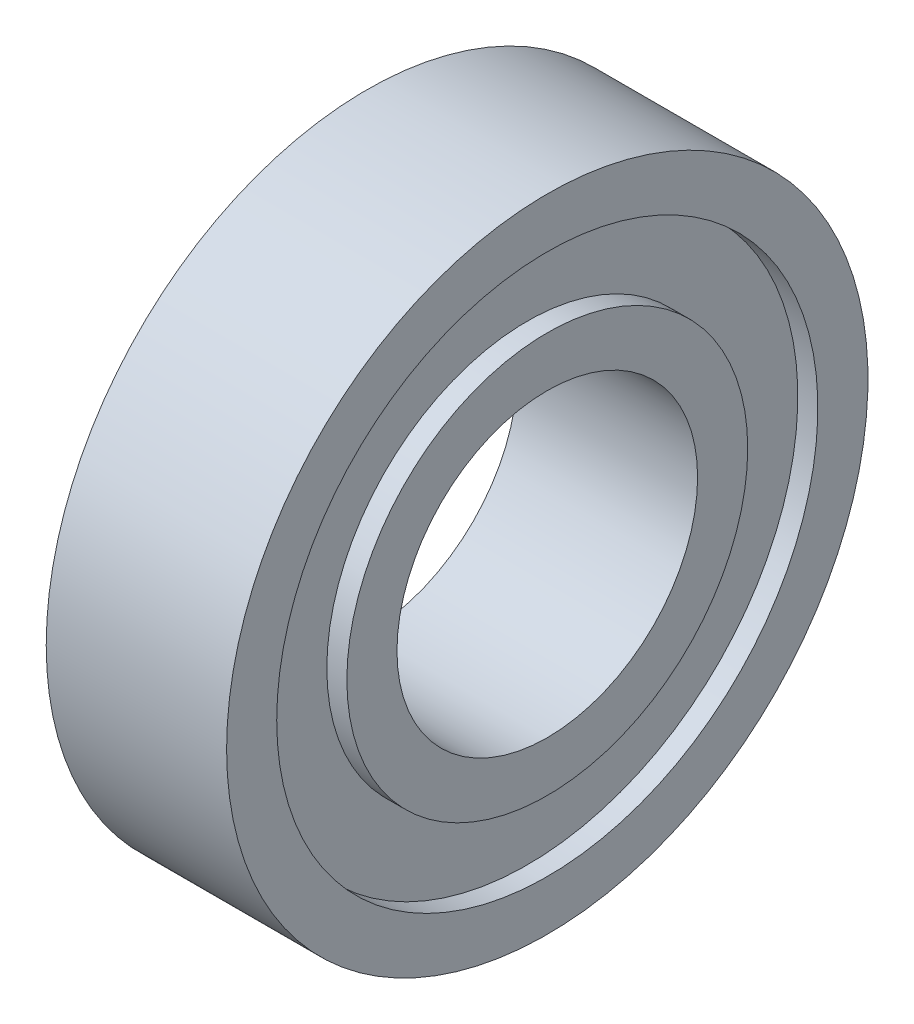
from build123d import *


with BuildPart() as part:
    # Esquisse1 → R_volution1 (revolve)
    with BuildSketch(Plane.XY, mode=Mode.PRIVATE) as r_volution1_sk:
        Polygon((0, 7.5), (9, 7.5), (9, 10), (8, 10), (8, 13.5), (9, 13.5), (9, 16), (0, 16), (0, 13.5), (1, 13.5), (1, 10), (0, 10), align=None)
    revolve(r_volution1_sk.sketch.rotate(Axis((0, 0, 0), (1, 0, 0)), 90), axis=Axis((0, 0, 0), (1, 0, 0)))


solid = part.part
